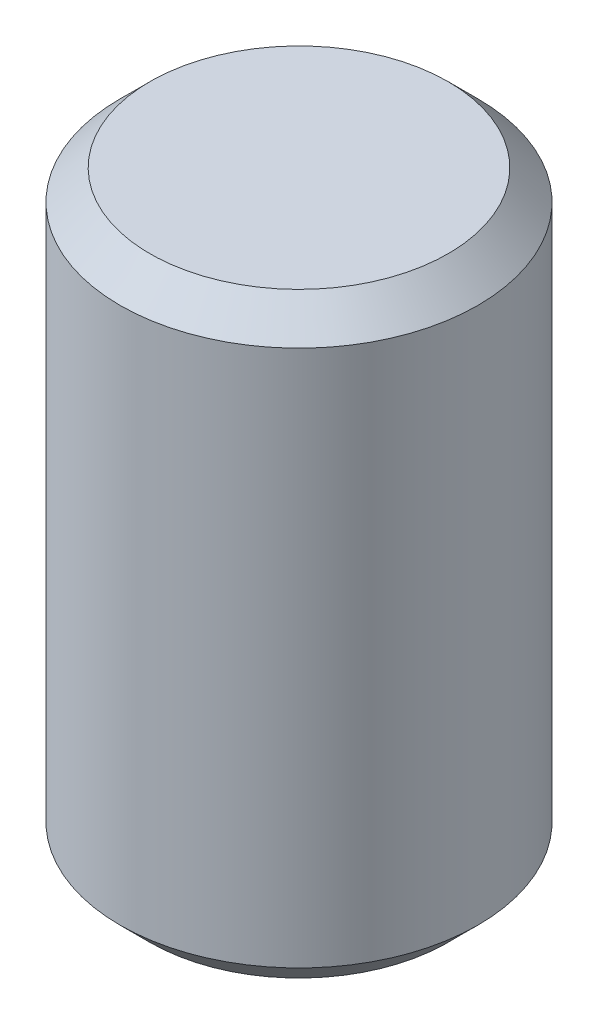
ISO-10303-21;
HEADER;
FILE_DESCRIPTION(('STEP AP214'),'2;1');
FILE_NAME('part.step','',(''),(''),'','','');
FILE_SCHEMA(('AUTOMOTIVE_DESIGN { 1 0 10303 214 1 1 1 1 }'));
ENDSEC;
DATA;
#1=APPLICATION_CONTEXT('core data for automotive mechanical design processes');
#2=APPLICATION_PROTOCOL_DEFINITION('international standard','automotive_design',2000,#1);
#3=PRODUCT_CONTEXT('',#1,'mechanical');
#4=PRODUCT('Part','Part','',(#3));
#5=PRODUCT_RELATED_PRODUCT_CATEGORY('part','',(#4));
#6=PRODUCT_DEFINITION_FORMATION('','',#4);
#7=PRODUCT_DEFINITION_CONTEXT('part definition',#1,'design');
#8=PRODUCT_DEFINITION('design','',#6,#7);
#9=PRODUCT_DEFINITION_SHAPE('','',#8);
#10=(LENGTH_UNIT() NAMED_UNIT(*) SI_UNIT(.MILLI.,.METRE.));
#11=(NAMED_UNIT(*) PLANE_ANGLE_UNIT() SI_UNIT($,.RADIAN.));
#12=(NAMED_UNIT(*) SI_UNIT($,.STERADIAN.) SOLID_ANGLE_UNIT());
#13=UNCERTAINTY_MEASURE_WITH_UNIT(LENGTH_MEASURE(1.E-05),#10,'distance_accuracy_value','');
#14=(GEOMETRIC_REPRESENTATION_CONTEXT(3) GLOBAL_UNCERTAINTY_ASSIGNED_CONTEXT((#13)) GLOBAL_UNIT_ASSIGNED_CONTEXT((#10,
#11,#12)) REPRESENTATION_CONTEXT('',''));
#15=CARTESIAN_POINT('',(0.,0.,0.));
#16=DIRECTION('',(0.,0.,1.));
#17=DIRECTION('',(1.,0.,0.));
#18=AXIS2_PLACEMENT_3D('',#15,#16,#17);
#19=CARTESIAN_POINT('',(0.,0.,0.));
#20=DIRECTION('',(0.,1.,0.));
#21=DIRECTION('',(0.,0.,1.));
#22=AXIS2_PLACEMENT_3D('',#19,#20,#21);
#23=PLANE('',#22);
#24=CARTESIAN_POINT('',(0.,0.,0.));
#25=DIRECTION('',(0.,1.,0.));
#26=DIRECTION('',(0.,0.,1.));
#27=AXIS2_PLACEMENT_3D('',#24,#25,#26);
#28=CIRCLE('',#27,2.5);
#29=CARTESIAN_POINT('',(0.,0.,2.5));
#30=VERTEX_POINT('',#29);
#31=EDGE_CURVE('E11',#30,#30,#28,.F.);
#32=ORIENTED_EDGE('',*,*,#31,.T.);
#33=EDGE_LOOP('',(#32));
#34=FACE_BOUND('',#33,.T.);
#35=DIRECTION('',(0.866025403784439,0.,0.5));
#36=VECTOR('',#35,1.);
#37=CARTESIAN_POINT('',(0.,0.,-1.73205080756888));
#38=LINE('',#37,#36);
#39=CARTESIAN_POINT('',(0.,0.,-1.73205080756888));
#40=VERTEX_POINT('',#39);
#41=CARTESIAN_POINT('',(1.5,0.,-0.866025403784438));
#42=VERTEX_POINT('',#41);
#43=EDGE_CURVE('E416',#40,#42,#38,.T.);
#44=ORIENTED_EDGE('',*,*,#43,.F.);
#45=DIRECTION('',(0.866025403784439,0.,-0.5));
#46=VECTOR('',#45,1.);
#47=CARTESIAN_POINT('',(-1.5,0.,-0.866025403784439));
#48=LINE('',#47,#46);
#49=CARTESIAN_POINT('',(-1.5,0.,-0.866025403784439));
#50=VERTEX_POINT('',#49);
#51=EDGE_CURVE('E362',#50,#40,#48,.T.);
#52=ORIENTED_EDGE('',*,*,#51,.F.);
#53=DIRECTION('',(0.,0.,-1.));
#54=VECTOR('',#53,1.);
#55=CARTESIAN_POINT('',(-1.5,0.,0.866025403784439));
#56=LINE('',#55,#54);
#57=CARTESIAN_POINT('',(-1.5,0.,0.866025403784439));
#58=VERTEX_POINT('',#57);
#59=EDGE_CURVE('E430',#58,#50,#56,.T.);
#60=ORIENTED_EDGE('',*,*,#59,.F.);
#61=DIRECTION('',(-0.866025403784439,0.,-0.5));
#62=VECTOR('',#61,1.);
#63=CARTESIAN_POINT('',(0.,0.,1.73205080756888));
#64=LINE('',#63,#62);
#65=CARTESIAN_POINT('',(0.,0.,1.73205080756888));
#66=VERTEX_POINT('',#65);
#67=EDGE_CURVE('E424',#66,#58,#64,.T.);
#68=ORIENTED_EDGE('',*,*,#67,.F.);
#69=DIRECTION('',(-0.866025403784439,0.,0.5));
#70=VECTOR('',#69,1.);
#71=CARTESIAN_POINT('',(1.5,0.,0.866025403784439));
#72=LINE('',#71,#70);
#73=CARTESIAN_POINT('',(1.5,0.,0.866025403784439));
#74=VERTEX_POINT('',#73);
#75=EDGE_CURVE('E422',#74,#66,#72,.T.);
#76=ORIENTED_EDGE('',*,*,#75,.F.);
#77=DIRECTION('',(0.,0.,1.));
#78=VECTOR('',#77,1.);
#79=CARTESIAN_POINT('',(1.5,0.,-0.866025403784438));
#80=LINE('',#79,#78);
#81=EDGE_CURVE('E405',#42,#74,#80,.T.);
#82=ORIENTED_EDGE('',*,*,#81,.F.);
#83=EDGE_LOOP('',(#44,#52,#60,#68,#76,#82));
#84=FACE_BOUND('',#83,.T.);
#85=ADVANCED_FACE('F348',(#34,#84),#23,.F.);
#86=CARTESIAN_POINT('',(0.,10.,0.));
#87=DIRECTION('',(0.,1.,0.));
#88=DIRECTION('',(0.,0.,1.));
#89=AXIS2_PLACEMENT_3D('',#86,#87,#88);
#90=CYLINDRICAL_SURFACE('',#89,3.);
#91=CARTESIAN_POINT('',(0.,9.49999999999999,0.));
#92=DIRECTION('',(0.,-1.,0.));
#93=DIRECTION('',(0.,0.,-1.));
#94=AXIS2_PLACEMENT_3D('',#91,#92,#93);
#95=CIRCLE('',#94,3.);
#96=CARTESIAN_POINT('',(0.,9.49999999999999,-3.));
#97=VERTEX_POINT('',#96);
#98=EDGE_CURVE('E355',#97,#97,#95,.T.);
#99=ORIENTED_EDGE('',*,*,#98,.T.);
#100=EDGE_LOOP('',(#99));
#101=FACE_BOUND('',#100,.T.);
#102=CARTESIAN_POINT('',(0.,0.500000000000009,0.));
#103=DIRECTION('',(0.,1.,0.));
#104=DIRECTION('',(0.,0.,1.));
#105=AXIS2_PLACEMENT_3D('',#102,#103,#104);
#106=CIRCLE('',#105,3.);
#107=CARTESIAN_POINT('',(0.,0.500000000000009,3.));
#108=VERTEX_POINT('',#107);
#109=EDGE_CURVE('E457',#108,#108,#106,.T.);
#110=ORIENTED_EDGE('',*,*,#109,.T.);
#111=EDGE_LOOP('',(#110));
#112=FACE_BOUND('',#111,.T.);
#113=ADVANCED_FACE('F462',(#101,#112),#90,.T.);
#114=CARTESIAN_POINT('',(0.,10.,0.));
#115=DIRECTION('',(0.,-1.,0.));
#116=DIRECTION('',(0.,0.,-1.));
#117=AXIS2_PLACEMENT_3D('',#114,#115,#116);
#118=PLANE('',#117);
#119=CARTESIAN_POINT('',(0.,10.,0.));
#120=DIRECTION('',(0.,-1.,0.));
#121=DIRECTION('',(0.,0.,-1.));
#122=AXIS2_PLACEMENT_3D('',#119,#120,#121);
#123=CIRCLE('',#122,2.5);
#124=CARTESIAN_POINT('',(0.,10.,-2.5));
#125=VERTEX_POINT('',#124);
#126=EDGE_CURVE('E448',#125,#125,#123,.F.);
#127=ORIENTED_EDGE('',*,*,#126,.T.);
#128=EDGE_LOOP('',(#127));
#129=FACE_BOUND('',#128,.T.);
#130=ADVANCED_FACE('F473',(#129),#118,.F.);
#131=CARTESIAN_POINT('',(-1.5,4.,-0.866025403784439));
#132=DIRECTION('',(-0.5,0.,-0.866025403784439));
#133=DIRECTION('',(-0.866025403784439,0.,0.5));
#134=AXIS2_PLACEMENT_3D('',#131,#132,#133);
#135=PLANE('',#134);
#136=ORIENTED_EDGE('',*,*,#51,.T.);
#137=DIRECTION('',(0.,-1.,0.));
#138=VECTOR('',#137,1.);
#139=CARTESIAN_POINT('',(0.,4.,-1.73205080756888));
#140=LINE('',#139,#138);
#141=CARTESIAN_POINT('',(0.,4.,-1.73205080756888));
#142=VERTEX_POINT('',#141);
#143=EDGE_CURVE('E413',#142,#40,#140,.T.);
#144=ORIENTED_EDGE('',*,*,#143,.F.);
#145=DIRECTION('',(0.866025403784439,0.,-0.5));
#146=VECTOR('',#145,1.);
#147=CARTESIAN_POINT('',(-1.5,4.,-0.866025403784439));
#148=LINE('',#147,#146);
#149=CARTESIAN_POINT('',(-1.5,4.,-0.866025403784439));
#150=VERTEX_POINT('',#149);
#151=EDGE_CURVE('E432',#150,#142,#148,.T.);
#152=ORIENTED_EDGE('',*,*,#151,.F.);
#153=DIRECTION('',(0.,-1.,0.));
#154=VECTOR('',#153,1.);
#155=CARTESIAN_POINT('',(-1.5,4.,-0.866025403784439));
#156=LINE('',#155,#154);
#157=EDGE_CURVE('E369',#150,#50,#156,.T.);
#158=ORIENTED_EDGE('',*,*,#157,.T.);
#159=EDGE_LOOP('',(#136,#144,#152,#158));
#160=FACE_BOUND('',#159,.T.);
#161=ADVANCED_FACE('F475',(#160),#135,.F.);
#162=CARTESIAN_POINT('',(-1.5,4.,0.866025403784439));
#163=DIRECTION('',(-1.,0.,0.));
#164=DIRECTION('',(0.,0.,1.));
#165=AXIS2_PLACEMENT_3D('',#162,#163,#164);
#166=PLANE('',#165);
#167=ORIENTED_EDGE('',*,*,#59,.T.);
#168=ORIENTED_EDGE('',*,*,#157,.F.);
#169=DIRECTION('',(0.,0.,-1.));
#170=VECTOR('',#169,1.);
#171=CARTESIAN_POINT('',(-1.5,4.,0.866025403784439));
#172=LINE('',#171,#170);
#173=CARTESIAN_POINT('',(-1.5,4.,0.866025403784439));
#174=VERTEX_POINT('',#173);
#175=EDGE_CURVE('E444',#174,#150,#172,.T.);
#176=ORIENTED_EDGE('',*,*,#175,.F.);
#177=DIRECTION('',(0.,-1.,0.));
#178=VECTOR('',#177,1.);
#179=CARTESIAN_POINT('',(-1.5,4.,0.866025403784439));
#180=LINE('',#179,#178);
#181=EDGE_CURVE('E449',#174,#58,#180,.T.);
#182=ORIENTED_EDGE('',*,*,#181,.T.);
#183=EDGE_LOOP('',(#167,#168,#176,#182));
#184=FACE_BOUND('',#183,.T.);
#185=ADVANCED_FACE('F479',(#184),#166,.F.);
#186=CARTESIAN_POINT('',(0.,4.,1.73205080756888));
#187=DIRECTION('',(-0.5,0.,0.866025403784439));
#188=DIRECTION('',(0.866025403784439,0.,0.5));
#189=AXIS2_PLACEMENT_3D('',#186,#187,#188);
#190=PLANE('',#189);
#191=ORIENTED_EDGE('',*,*,#67,.T.);
#192=ORIENTED_EDGE('',*,*,#181,.F.);
#193=DIRECTION('',(-0.866025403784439,0.,-0.5));
#194=VECTOR('',#193,1.);
#195=CARTESIAN_POINT('',(0.,4.,1.73205080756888));
#196=LINE('',#195,#194);
#197=CARTESIAN_POINT('',(0.,4.,1.73205080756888));
#198=VERTEX_POINT('',#197);
#199=EDGE_CURVE('E441',#198,#174,#196,.T.);
#200=ORIENTED_EDGE('',*,*,#199,.F.);
#201=DIRECTION('',(0.,-1.,0.));
#202=VECTOR('',#201,1.);
#203=CARTESIAN_POINT('',(0.,4.,1.73205080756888));
#204=LINE('',#203,#202);
#205=EDGE_CURVE('E451',#198,#66,#204,.T.);
#206=ORIENTED_EDGE('',*,*,#205,.T.);
#207=EDGE_LOOP('',(#191,#192,#200,#206));
#208=FACE_BOUND('',#207,.T.);
#209=ADVANCED_FACE('F500',(#208),#190,.F.);
#210=CARTESIAN_POINT('',(1.5,4.,0.866025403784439));
#211=DIRECTION('',(0.5,0.,0.866025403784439));
#212=DIRECTION('',(0.866025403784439,0.,-0.5));
#213=AXIS2_PLACEMENT_3D('',#210,#211,#212);
#214=PLANE('',#213);
#215=ORIENTED_EDGE('',*,*,#75,.T.);
#216=ORIENTED_EDGE('',*,*,#205,.F.);
#217=DIRECTION('',(-0.866025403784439,0.,0.5));
#218=VECTOR('',#217,1.);
#219=CARTESIAN_POINT('',(1.5,4.,0.866025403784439));
#220=LINE('',#219,#218);
#221=CARTESIAN_POINT('',(1.5,4.,0.866025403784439));
#222=VERTEX_POINT('',#221);
#223=EDGE_CURVE('E438',#222,#198,#220,.T.);
#224=ORIENTED_EDGE('',*,*,#223,.F.);
#225=DIRECTION('',(0.,-1.,0.));
#226=VECTOR('',#225,1.);
#227=CARTESIAN_POINT('',(1.5,4.,0.866025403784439));
#228=LINE('',#227,#226);
#229=EDGE_CURVE('E412',#222,#74,#228,.T.);
#230=ORIENTED_EDGE('',*,*,#229,.T.);
#231=EDGE_LOOP('',(#215,#216,#224,#230));
#232=FACE_BOUND('',#231,.T.);
#233=ADVANCED_FACE('F503',(#232),#214,.F.);
#234=CARTESIAN_POINT('',(1.5,4.,-0.866025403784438));
#235=DIRECTION('',(1.,0.,0.));
#236=DIRECTION('',(0.,0.,-1.));
#237=AXIS2_PLACEMENT_3D('',#234,#235,#236);
#238=PLANE('',#237);
#239=ORIENTED_EDGE('',*,*,#81,.T.);
#240=ORIENTED_EDGE('',*,*,#229,.F.);
#241=DIRECTION('',(0.,0.,1.));
#242=VECTOR('',#241,1.);
#243=CARTESIAN_POINT('',(1.5,4.,-0.866025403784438));
#244=LINE('',#243,#242);
#245=CARTESIAN_POINT('',(1.5,4.,-0.866025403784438));
#246=VERTEX_POINT('',#245);
#247=EDGE_CURVE('E408',#246,#222,#244,.T.);
#248=ORIENTED_EDGE('',*,*,#247,.F.);
#249=DIRECTION('',(0.,-1.,0.));
#250=VECTOR('',#249,1.);
#251=CARTESIAN_POINT('',(1.5,4.,-0.866025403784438));
#252=LINE('',#251,#250);
#253=EDGE_CURVE('E401',#246,#42,#252,.T.);
#254=ORIENTED_EDGE('',*,*,#253,.T.);
#255=EDGE_LOOP('',(#239,#240,#248,#254));
#256=FACE_BOUND('',#255,.T.);
#257=ADVANCED_FACE('F403',(#256),#238,.F.);
#258=CARTESIAN_POINT('',(0.,4.,-1.73205080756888));
#259=DIRECTION('',(0.5,0.,-0.866025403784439));
#260=DIRECTION('',(-0.866025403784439,0.,-0.5));
#261=AXIS2_PLACEMENT_3D('',#258,#259,#260);
#262=PLANE('',#261);
#263=ORIENTED_EDGE('',*,*,#43,.T.);
#264=ORIENTED_EDGE('',*,*,#253,.F.);
#265=DIRECTION('',(0.866025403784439,0.,0.5));
#266=VECTOR('',#265,1.);
#267=CARTESIAN_POINT('',(0.,4.,-1.73205080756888));
#268=LINE('',#267,#266);
#269=EDGE_CURVE('E435',#142,#246,#268,.T.);
#270=ORIENTED_EDGE('',*,*,#269,.F.);
#271=ORIENTED_EDGE('',*,*,#143,.T.);
#272=EDGE_LOOP('',(#263,#264,#270,#271));
#273=FACE_BOUND('',#272,.T.);
#274=ADVANCED_FACE('F417',(#273),#262,.F.);
#275=CARTESIAN_POINT('',(1.5,4.,-2.59807621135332));
#276=DIRECTION('',(0.,-1.,0.));
#277=DIRECTION('',(0.,0.,-1.));
#278=AXIS2_PLACEMENT_3D('',#275,#276,#277);
#279=PLANE('',#278);
#280=ORIENTED_EDGE('',*,*,#151,.T.);
#281=ORIENTED_EDGE('',*,*,#269,.T.);
#282=ORIENTED_EDGE('',*,*,#247,.T.);
#283=ORIENTED_EDGE('',*,*,#223,.T.);
#284=ORIENTED_EDGE('',*,*,#199,.T.);
#285=ORIENTED_EDGE('',*,*,#175,.T.);
#286=EDGE_LOOP('',(#280,#281,#282,#283,#284,#285));
#287=FACE_BOUND('',#286,.T.);
#288=ADVANCED_FACE('F469',(#287),#279,.T.);
#289=CARTESIAN_POINT('',(0.,10.,0.));
#290=DIRECTION('',(0.,-1.,0.));
#291=DIRECTION('',(0.,0.,-1.));
#292=AXIS2_PLACEMENT_3D('',#289,#290,#291);
#293=CONICAL_SURFACE('',#292,2.5,0.785398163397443);
#294=ORIENTED_EDGE('',*,*,#98,.F.);
#295=EDGE_LOOP('',(#294));
#296=FACE_BOUND('',#295,.T.);
#297=ORIENTED_EDGE('',*,*,#126,.F.);
#298=EDGE_LOOP('',(#297));
#299=FACE_BOUND('',#298,.T.);
#300=ADVANCED_FACE('F465',(#296,#299),#293,.T.);
#301=CARTESIAN_POINT('',(0.,0.500000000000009,0.));
#302=DIRECTION('',(0.,1.,0.));
#303=DIRECTION('',(0.,0.,1.));
#304=AXIS2_PLACEMENT_3D('',#301,#302,#303);
#305=CONICAL_SURFACE('',#304,3.,0.785398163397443);
#306=ORIENTED_EDGE('',*,*,#31,.F.);
#307=EDGE_LOOP('',(#306));
#308=FACE_BOUND('',#307,.T.);
#309=ORIENTED_EDGE('',*,*,#109,.F.);
#310=EDGE_LOOP('',(#309));
#311=FACE_BOUND('',#310,.T.);
#312=ADVANCED_FACE('F468',(#308,#311),#305,.T.);
#313=CLOSED_SHELL('',(#85,#113,#130,#161,#185,#209,#233,#257,#274,#288,#300,#312));
#314=MANIFOLD_SOLID_BREP('B2',#313);
#315=ADVANCED_BREP_SHAPE_REPRESENTATION('',(#18,#314),#14);
#316=SHAPE_DEFINITION_REPRESENTATION(#9,#315);
ENDSEC;
END-ISO-10303-21;
